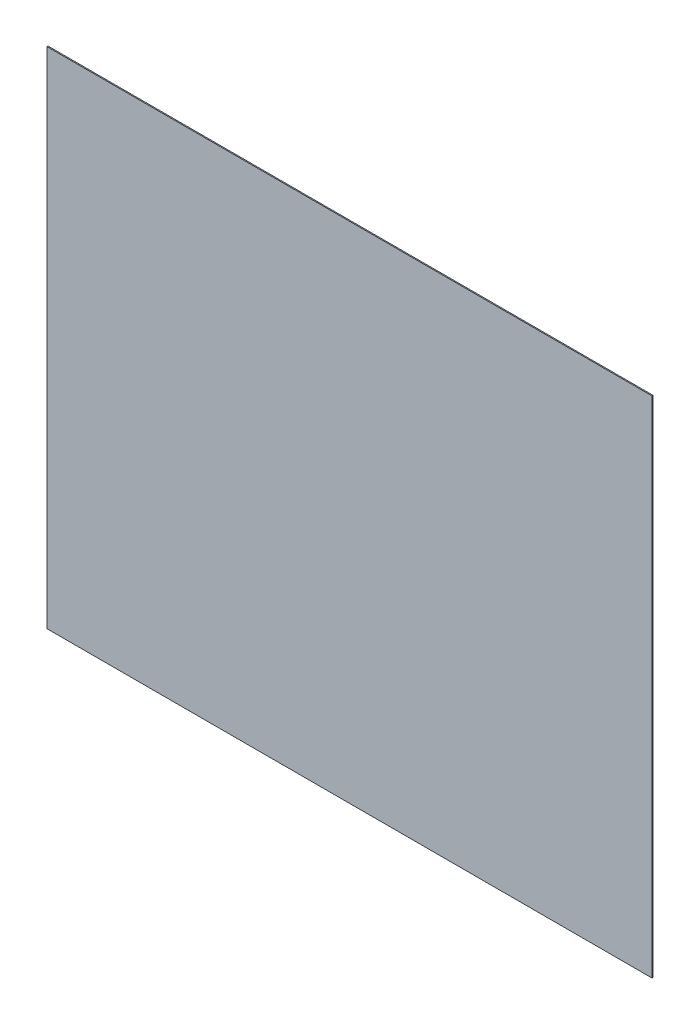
from build123d import *

# Parameters (mm, degrees)
SKETCH1_W           = 3657.6
SKETCH1_H           = 3048
BOSS_EXTRUDE1_DEPTH = 6.35


with BuildPart() as part:
    # Sketch1 → Boss-Extrude1 (new body)
    with BuildSketch(Plane.XY):
        Rectangle(SKETCH1_W, SKETCH1_H)
    extrude(amount=-BOSS_EXTRUDE1_DEPTH)


solid = part.part
